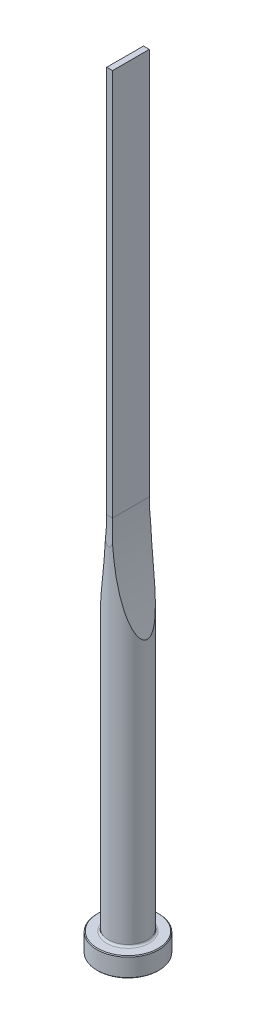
from build123d import *

# Parameters (mm, degrees)
CUT_EXTRUDE1_DEPTH = 5
CUT_EXTRUDE2_DEPTH = 5


with BuildPart() as part:
    # Sketch1 → Revolve1 (revolve)
    with BuildSketch(Plane.XY, mode=Mode.PRIVATE) as revolve1_sk:
        with BuildLine():
            Line((0, 0), (7.8, 0))
            Line((7.8, 0), (8, 0.2))
            Line((8, 0.2), (8, 4.8))
            Line((8, 4.8), (7.8, 5))
            Line((7.8, 5), (5.5, 5))
            ThreePointArc((5.5, 5), (5.146446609, 5.146446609), (5, 5.5))
            Line((5, 5.5), (5, 200))
            Line((5, 200), (0, 200))
            Line((0, 200), (0, 0))
        make_face()
    revolve(revolve1_sk.sketch.rotate(Axis((0, 200, 0), (0, -1, 0)), 180), axis=Axis((0, 200, 0), (0, -1, 0)))

    # Sketch2 → Cut-Extrude1 (cut, symmetric)
    with BuildSketch(Plane.XY):
        with BuildLine():
            Line((0.75, 200), (0.75, 100))
            ThreePointArc((0.75, 100), (1.818846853, 86.170683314), (5, 72.669842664))
            Line((5, 72.669842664), (5, 200))
            Line((5, 200), (0.75, 200))
        make_face()
        with BuildLine():
            Line((-0.75, 200), (-0.75, 100))
            ThreePointArc((-0.75, 100), (-1.818846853, 86.170683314), (-5, 72.669842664))
            Line((-5, 72.669842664), (-5, 200))
            Line((-5, 200), (-0.75, 200))
        make_face()
    extrude(amount=CUT_EXTRUDE1_DEPTH, both=True, mode=Mode.SUBTRACT)

    # Sketch3 → Cut-Extrude2 (cut, symmetric)
    with BuildSketch(Plane(origin=(0, 0, 0), x_dir=(0, 0, -1), z_dir=(1, 0, 0))):
        with BuildLine():
            Line((4.75, 200), (4.75, 100))
            ThreePointArc((4.75, 100), (4.812521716, 96.645898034), (5, 93.296456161))
            Line((5, 93.296456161), (5, 200))
            Line((5, 200), (4.75, 200))
        make_face()
        with BuildLine():
            Line((-4.75, 200), (-4.75, 100))
            ThreePointArc((-4.75, 100), (-4.812521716, 96.645898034), (-5, 93.296456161))
            Line((-5, 93.296456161), (-5, 200))
            Line((-5, 200), (-4.75, 200))
        make_face()
    extrude(amount=CUT_EXTRUDE2_DEPTH, both=True, mode=Mode.SUBTRACT)


solid = part.part
